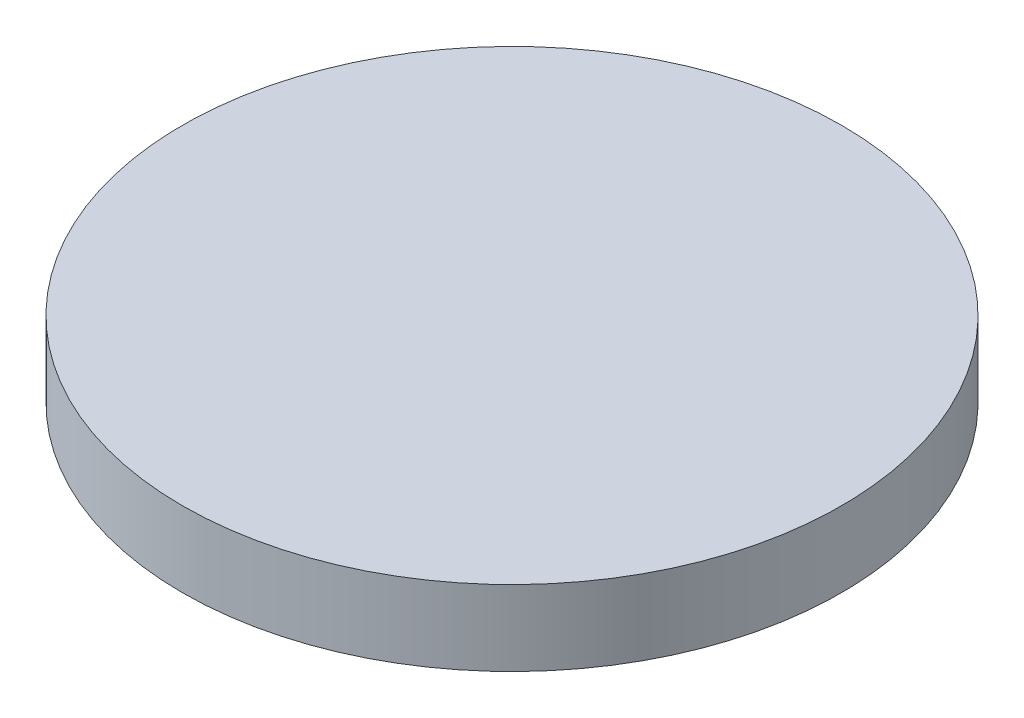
ISO-10303-21;
HEADER;
FILE_DESCRIPTION(('STEP AP214'),'2;1');
FILE_NAME('part.step','',(''),(''),'','','');
FILE_SCHEMA(('AUTOMOTIVE_DESIGN { 1 0 10303 214 1 1 1 1 }'));
ENDSEC;
DATA;
#1=APPLICATION_CONTEXT('core data for automotive mechanical design processes');
#2=APPLICATION_PROTOCOL_DEFINITION('international standard','automotive_design',2000,#1);
#3=PRODUCT_CONTEXT('',#1,'mechanical');
#4=PRODUCT('Part','Part','',(#3));
#5=PRODUCT_RELATED_PRODUCT_CATEGORY('part','',(#4));
#6=PRODUCT_DEFINITION_FORMATION('','',#4);
#7=PRODUCT_DEFINITION_CONTEXT('part definition',#1,'design');
#8=PRODUCT_DEFINITION('design','',#6,#7);
#9=PRODUCT_DEFINITION_SHAPE('','',#8);
#10=(LENGTH_UNIT() NAMED_UNIT(*) SI_UNIT(.MILLI.,.METRE.));
#11=(NAMED_UNIT(*) PLANE_ANGLE_UNIT() SI_UNIT($,.RADIAN.));
#12=(NAMED_UNIT(*) SI_UNIT($,.STERADIAN.) SOLID_ANGLE_UNIT());
#13=UNCERTAINTY_MEASURE_WITH_UNIT(LENGTH_MEASURE(1.E-05),#10,'distance_accuracy_value','');
#14=(GEOMETRIC_REPRESENTATION_CONTEXT(3) GLOBAL_UNCERTAINTY_ASSIGNED_CONTEXT((#13)) GLOBAL_UNIT_ASSIGNED_CONTEXT((#10,
#11,#12)) REPRESENTATION_CONTEXT('',''));
#15=CARTESIAN_POINT('',(0.,0.,0.));
#16=DIRECTION('',(0.,0.,1.));
#17=DIRECTION('',(1.,0.,0.));
#18=AXIS2_PLACEMENT_3D('',#15,#16,#17);
#19=CARTESIAN_POINT('',(0.,10.,0.));
#20=DIRECTION('',(0.,-1.,0.));
#21=DIRECTION('',(0.,0.,-1.));
#22=AXIS2_PLACEMENT_3D('',#19,#20,#21);
#23=CYLINDRICAL_SURFACE('',#22,43.75);
#24=CARTESIAN_POINT('',(0.,10.,0.));
#25=DIRECTION('',(0.,1.,0.));
#26=DIRECTION('',(0.,0.,1.));
#27=AXIS2_PLACEMENT_3D('',#24,#25,#26);
#28=CIRCLE('',#27,43.75);
#29=CARTESIAN_POINT('',(0.,10.,43.75));
#30=VERTEX_POINT('',#29);
#31=EDGE_CURVE('E10',#30,#30,#28,.T.);
#32=ORIENTED_EDGE('',*,*,#31,.F.);
#33=EDGE_LOOP('',(#32));
#34=FACE_BOUND('',#33,.T.);
#35=CARTESIAN_POINT('',(0.,0.,0.));
#36=DIRECTION('',(0.,1.,0.));
#37=DIRECTION('',(0.,0.,1.));
#38=AXIS2_PLACEMENT_3D('',#35,#36,#37);
#39=CIRCLE('',#38,43.75);
#40=CARTESIAN_POINT('',(0.,0.,43.75));
#41=VERTEX_POINT('',#40);
#42=EDGE_CURVE('E36',#41,#41,#39,.T.);
#43=ORIENTED_EDGE('',*,*,#42,.T.);
#44=EDGE_LOOP('',(#43));
#45=FACE_BOUND('',#44,.T.);
#46=ADVANCED_FACE('F33',(#34,#45),#23,.T.);
#47=CARTESIAN_POINT('',(0.,10.,0.));
#48=DIRECTION('',(0.,1.,0.));
#49=DIRECTION('',(0.,0.,1.));
#50=AXIS2_PLACEMENT_3D('',#47,#48,#49);
#51=PLANE('',#50);
#52=ORIENTED_EDGE('',*,*,#31,.T.);
#53=EDGE_LOOP('',(#52));
#54=FACE_BOUND('',#53,.T.);
#55=ADVANCED_FACE('F48',(#54),#51,.T.);
#56=CARTESIAN_POINT('',(0.,0.,0.));
#57=DIRECTION('',(0.,1.,0.));
#58=DIRECTION('',(0.,0.,1.));
#59=AXIS2_PLACEMENT_3D('',#56,#57,#58);
#60=PLANE('',#59);
#61=ORIENTED_EDGE('',*,*,#42,.F.);
#62=EDGE_LOOP('',(#61));
#63=FACE_BOUND('',#62,.T.);
#64=ADVANCED_FACE('F46',(#63),#60,.F.);
#65=CLOSED_SHELL('',(#46,#55,#64));
#66=MANIFOLD_SOLID_BREP('B2',#65);
#67=ADVANCED_BREP_SHAPE_REPRESENTATION('',(#18,#66),#14);
#68=SHAPE_DEFINITION_REPRESENTATION(#9,#67);
ENDSEC;
END-ISO-10303-21;
